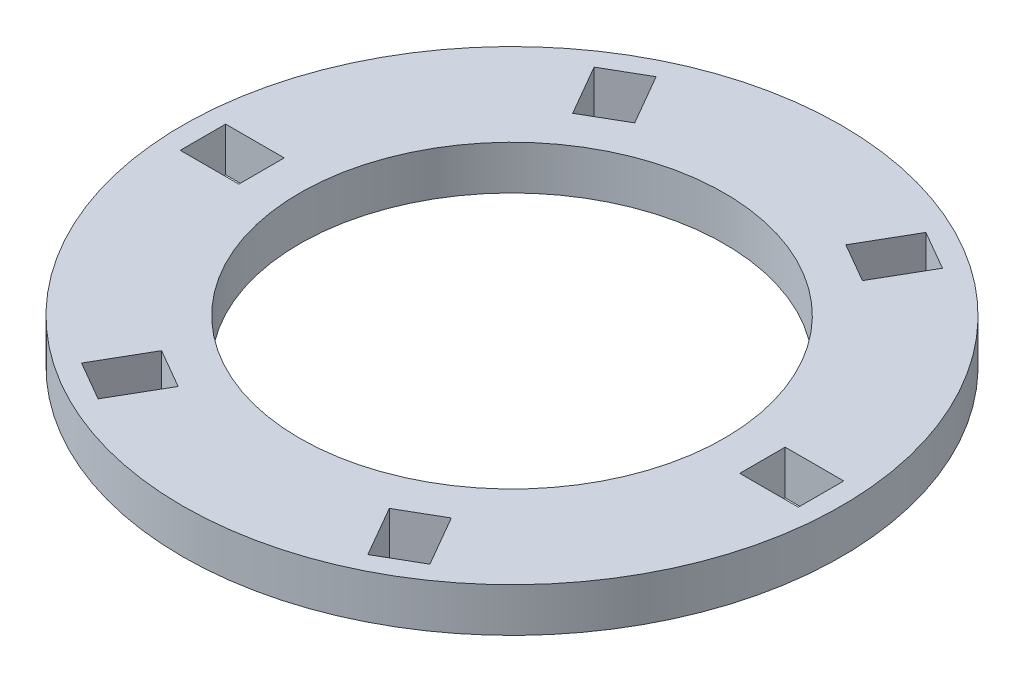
from build123d import *

# Parameters (mm, degrees)
SKETCH1_R           = 45
BOSS_EXTRUDE1_DEPTH = 6
SKETCH2_R           = 29
BEARING_BORE_DEPTH  = 64.921827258
SKETCH5_W           = 8
SKETCH5_H           = 6.2
WEDGE_SLOT_DEPTH    = 64.921827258
CIRPATTERN1_COUNT   = 6


with BuildPart() as part:
    # Sketch1 → Boss-Extrude1 (new body)
    with BuildSketch(Plane(origin=(0, 0, 0), x_dir=(1, 0, 0), z_dir=(0, 1, 0))):
        with Locations(Location((0, 0, 0), (0, 0, 90))):
            Circle(SKETCH1_R)
    extrude(amount=BOSS_EXTRUDE1_DEPTH)

    # Sketch2 → bearing bore (cut, through all)
    with BuildSketch(Plane(origin=(0, 6, 0), x_dir=(1, 0, 0), z_dir=(0, 1, 0))):
        with Locations(Location((0, 0, 0), (0, 0, 270))):
            Circle(SKETCH2_R)
    extrude(amount=-BEARING_BORE_DEPTH, mode=Mode.SUBTRACT)

    # Sketch5 → wedge slot (cut, through all)
    with BuildSketch(Plane(origin=(0, 6, 0), x_dir=(1, 0, 0), z_dir=(0, 1, 0))):
        with Locations((-38.2, 0)):
            Rectangle(SKETCH5_W, SKETCH5_H)
    wedge_slot = extrude(amount=-WEDGE_SLOT_DEPTH, mode=Mode.SUBTRACT)

    # CirPattern1: wedge slot ×6 about axis
    cirpattern1_axis = Axis((0, 0, 0), (0, 1, 0))
    for i in range(1, CIRPATTERN1_COUNT):
        add(wedge_slot.rotate(cirpattern1_axis, i * 360 / CIRPATTERN1_COUNT), mode=Mode.SUBTRACT)


solid = part.part
